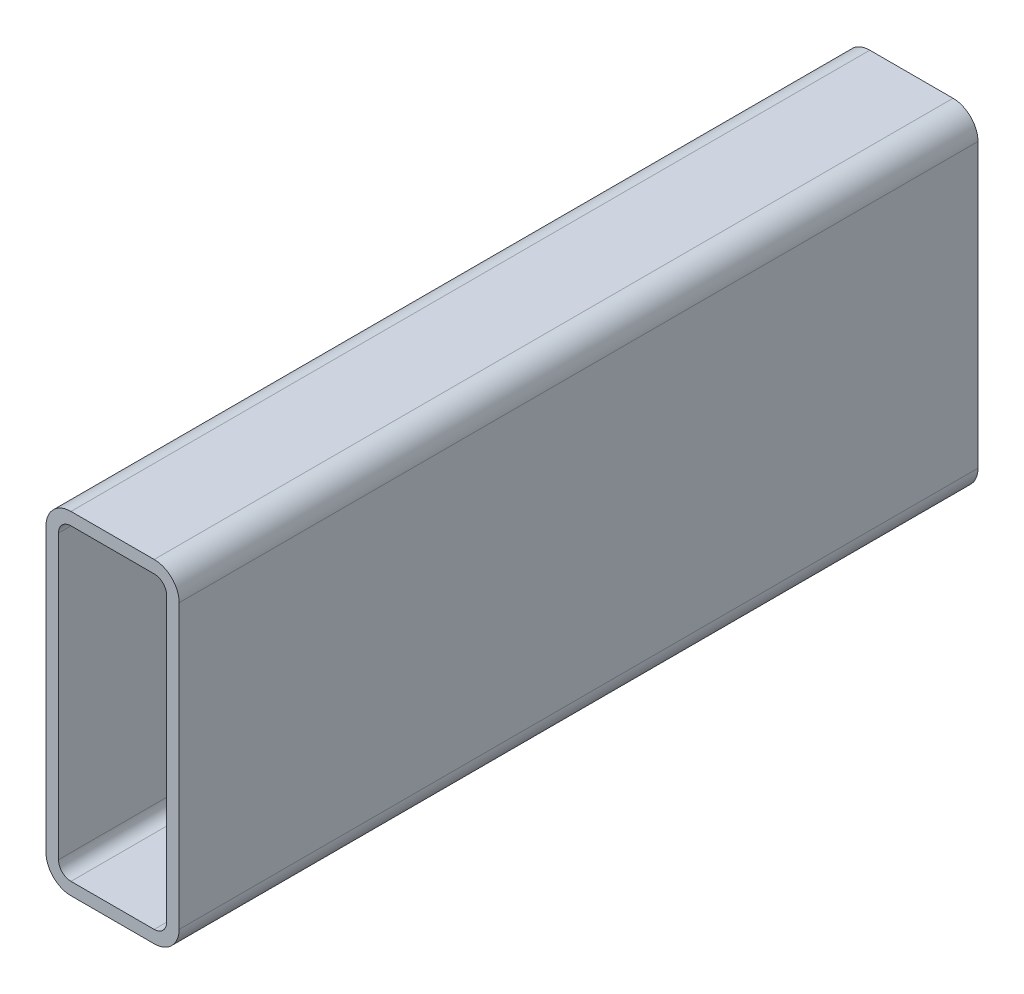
from build123d import *

# Parameters (mm, degrees)
BOSS_EXTRUDE1_DEPTH = 304.8


with BuildPart() as part:
    # Sketch1 → Boss-Extrude1 (new body)
    with BuildSketch(Plane.XY):
        with BuildLine():
            Line((9.525, 127), (41.275, 127))
            ThreePointArc((41.275, 127), (48.010192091, 124.210192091), (50.8, 117.475))
            Line((50.8, 117.475), (50.8, 9.525))
            ThreePointArc((50.8, 9.525), (48.010192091, 2.789807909), (41.275, 0))
            Line((41.275, 0), (9.525, 0))
            ThreePointArc((9.525, 0), (2.789807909, 2.789807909), (0, 9.525))
            Line((0, 9.525), (0, 117.475))
            ThreePointArc((0, 117.475), (2.789807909, 124.210192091), (9.525, 127))
        make_face()
        with BuildLine():
            Line((9.525, 122.2375), (41.275, 122.2375))
            ThreePointArc((41.275, 122.2375), (44.642596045, 120.842596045), (46.0375, 117.475))
            Line((46.0375, 117.475), (46.0375, 9.525))
            ThreePointArc((46.0375, 9.525), (44.642596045, 6.157403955), (41.275, 4.7625))
            Line((41.275, 4.7625), (9.525, 4.7625))
            ThreePointArc((9.525, 4.7625), (6.157403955, 6.157403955), (4.7625, 9.525))
            Line((4.7625, 9.525), (4.7625, 117.475))
            ThreePointArc((4.7625, 117.475), (6.157403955, 120.842596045), (9.525, 122.2375))
        make_face(mode=Mode.SUBTRACT)
    extrude(amount=BOSS_EXTRUDE1_DEPTH)


solid = part.part
